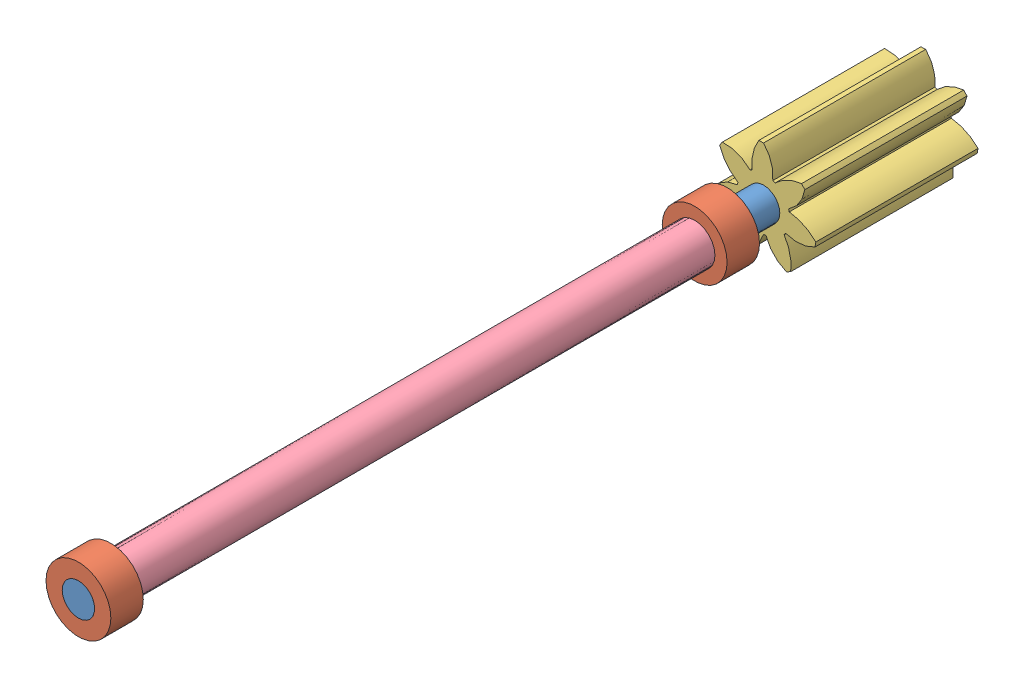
SolidWorks assembly moteur rotor1.SLDASM, configuration Default (file format 4100). Lengths in mm.
Overall size (2.6 2.6 21).
5 component instances, 4 part files, 8 mates.
Components (placement in the parent):
- moteur axe-1: moteur axe.SLDPRT [Default] at origin size (0.8 0.8 21)
- moteur guidage-1: moteur guidage.SLDPRT [Default] at (0 0 20.2) size (1.6 1.6 0.8)
- moteur guidage-2: moteur guidage.SLDPRT [Default] at (0 0 5) size (1.6 1.6 0.8)
- pignon moteur-1: pignon moteur.SLDPRT [Default] at (0 0 0.1) size (2.6 2.6 4)
- moteur entretoise-1: moteur entretoise.SLDPRT [Default] at (0 0 5.8) size (1 1 14.4)
Mates (geometry in assembly coordinates):
- Coaxiale1: concentric aligned: cylinder of moteur axe-1 through (0 0 21) axis (0 0 -1) radius 0.4; cylinder of moteur guidage-1 through (0 0 21) axis (0 0 -1) radius 0.4
- Coïncidente1: coincident aligned: plane of moteur axe-1 through (0 0 21) normal (0 0 1); plane of moteur guidage-1 through (0 0 21) normal (0 0 1)
- Coaxiale2: concentric aligned: cylinder of moteur axe-1 through (0 0 21) axis (0 0 -1) radius 0.4; cylinder of moteur guidage-2 through (0 0 5.8) axis (0 0 -1) radius 0.4
- Distance1: distance = 16 mm anti-aligned: plane of moteur guidage-1 through (0 0 21) normal (0 0 1); plane of moteur guidage-2 through (0 0 5) normal (0 0 -1)
- Coaxiale3: concentric aligned: cylinder of moteur axe-1 through (0 0 21) axis (0 0 -1) radius 0.4; cylinder of pignon moteur-1 through (0 0 4.1) axis (0 0 -1) radius 0.4
- Distance2: distance = 0.1 mm aligned: plane of moteur axe-1 through (0 0 0) normal (0 0 -1); plane of pignon moteur-1 through (0 0 0.1) normal (0 0 -1)
- Coaxiale4: concentric aligned: cylinder of moteur axe-1 through (0 0 21) axis (0 0 -1) radius 0.4; cylinder of moteur entretoise-1 through (0 0 20.2) axis (0 0 -1) radius 0.4
- Coïncidente2: coincident anti-aligned: plane of moteur guidage-1 through (0 0 20.2) normal (0 0 -1); plane of moteur entretoise-1 through (0 0 20.2) normal (0 0 1)
